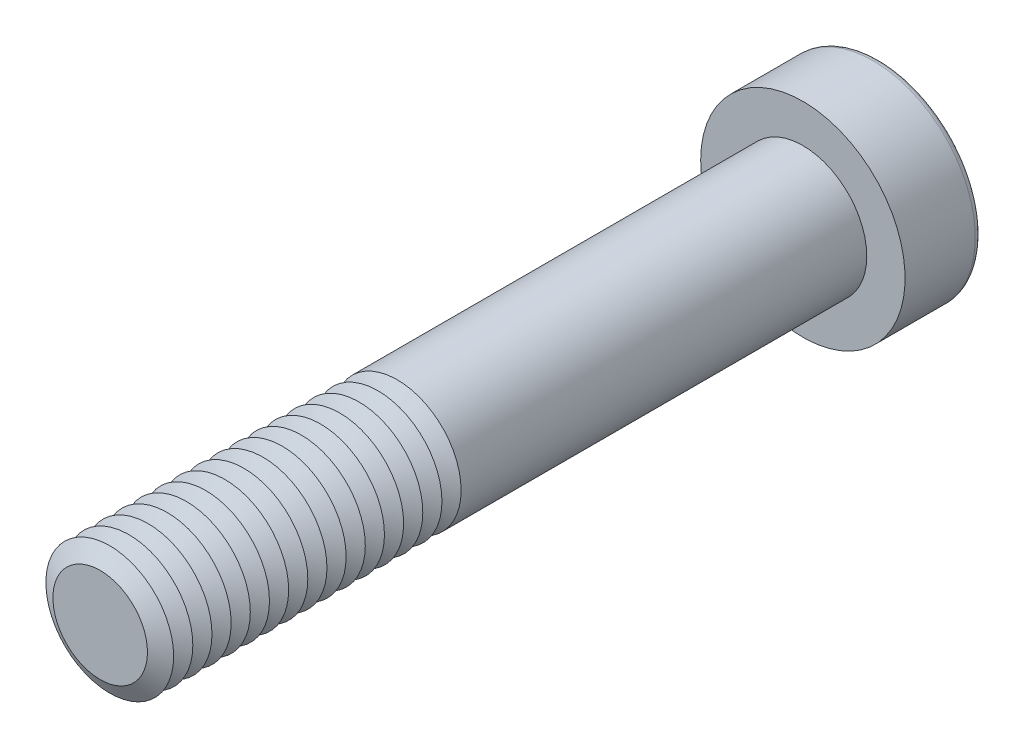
from build123d import *

# Parameters (mm, degrees)
SKETCH1_R           = 5
BOSS_EXTRUDE1_DEPTH = 55
SKETCH2_R           = 8
BOSS_EXTRUDE2_DEPTH = 6
CUT_EXTRUDE1_DEPTH  = 5.25
FILLET1_R           = 0.5
LPATTERN1_COUNT     = 16
LPATTERN1_PITCH     = 1.5


with BuildPart() as part:
    # Sketch1 → Boss-Extrude1 (new body)
    with BuildSketch(Plane.XY):
        Circle(SKETCH1_R)
    extrude(amount=BOSS_EXTRUDE1_DEPTH)

    # Sketch2 → Boss-Extrude2 (add)
    with BuildSketch(Plane(origin=(0, 0, 0), x_dir=(-1, 0, 0), z_dir=(0, 0, -1))):
        Circle(SKETCH2_R)
    extrude(amount=BOSS_EXTRUDE2_DEPTH)

    # Sketch3 → Cut-Extrude1 (cut)
    with BuildSketch(Plane(origin=(0, 0, -6), x_dir=(-1, 0, 0), z_dir=(0, 0, -1))):
        Polygon((-2.020725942, 3.5), (-4.041451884, 0), (-2.020725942, -3.5), (2.020725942, -3.5), (4.041451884, 0), (2.020725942, 3.5), align=None)
    extrude(amount=-CUT_EXTRUDE1_DEPTH, mode=Mode.SUBTRACT)

    # Fillet1
    fillet1_edges = [part.edges().sort_by_distance(p)[0] for p in [
        (8, 0, -6),
    ]]
    fillet(fillet1_edges, radius=FILLET1_R)

    # Cut-Extrude2 cone 1 section (on through the dimple's axis) → Cut-Extrude2 (revolve, cut)
    with BuildSketch(Plane(origin=(0, 0, -0.75), x_dir=(0, 1, 0), z_dir=(1, 0, 0))):
        Polygon((0, 0), (3.5, 0), (0, 2.020725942), align=None)
    revolve(axis=Axis((0, 0, -0.75), (0, 0, 1)), mode=Mode.SUBTRACT)

    # Cut-Extrude3 cone 1 section (on through the dimple's axis) → Cut-Extrude3 (revolve, cut)
    with BuildSketch(Plane(origin=(0, 0, -6), x_dir=(0, 1, 0), z_dir=(1, 0, 0))):
        Polygon((0, 0), (4.041451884, 0), (0, 1.082903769), align=None)
    revolve(axis=Axis((0, 0, -6), (0, 0, 1)), mode=Mode.SUBTRACT)

    # Sketch7 → Cut-Revolve1 (revolve, cut)
    with BuildSketch(Plane(origin=(0, 0, 0), x_dir=(0, 0, -1), z_dir=(1, 0, 0)), mode=Mode.PRIVATE) as cut_revolve1_sk:
        Polygon((-55, 3.700961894), (-54.25, 5), (-55.75, 5), align=None)
    cut_revolve1 = revolve(cut_revolve1_sk.sketch.rotate(Axis((0, 0, 55), (0, 0, -1)), 90), axis=Axis((0, 0, 55), (0, 0, -1)), mode=Mode.SUBTRACT)

    # LPattern1: Cut-Revolve1 ×16
    with Locations(*[(0, 0, -i * LPATTERN1_PITCH) for i in range(1, LPATTERN1_COUNT)]):
        add(cut_revolve1, mode=Mode.SUBTRACT)


solid = part.part
